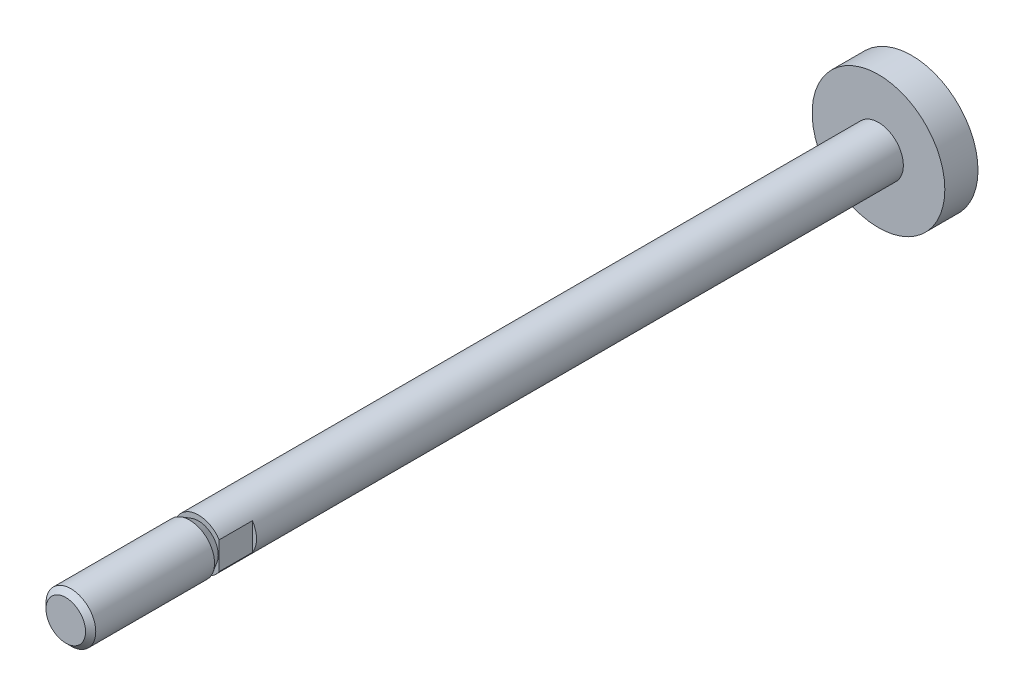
ISO-10303-21;
HEADER;
FILE_DESCRIPTION(('STEP AP214'),'2;1');
FILE_NAME('part.step','',(''),(''),'','','');
FILE_SCHEMA(('AUTOMOTIVE_DESIGN { 1 0 10303 214 1 1 1 1 }'));
ENDSEC;
DATA;
#1=APPLICATION_CONTEXT('core data for automotive mechanical design processes');
#2=APPLICATION_PROTOCOL_DEFINITION('international standard','automotive_design',2000,#1);
#3=PRODUCT_CONTEXT('',#1,'mechanical');
#4=PRODUCT('Part','Part','',(#3));
#5=PRODUCT_RELATED_PRODUCT_CATEGORY('part','',(#4));
#6=PRODUCT_DEFINITION_FORMATION('','',#4);
#7=PRODUCT_DEFINITION_CONTEXT('part definition',#1,'design');
#8=PRODUCT_DEFINITION('design','',#6,#7);
#9=PRODUCT_DEFINITION_SHAPE('','',#8);
#10=(LENGTH_UNIT() NAMED_UNIT(*) SI_UNIT(.MILLI.,.METRE.));
#11=(NAMED_UNIT(*) PLANE_ANGLE_UNIT() SI_UNIT($,.RADIAN.));
#12=(NAMED_UNIT(*) SI_UNIT($,.STERADIAN.) SOLID_ANGLE_UNIT());
#13=UNCERTAINTY_MEASURE_WITH_UNIT(LENGTH_MEASURE(1.E-05),#10,'distance_accuracy_value','');
#14=(GEOMETRIC_REPRESENTATION_CONTEXT(3) GLOBAL_UNCERTAINTY_ASSIGNED_CONTEXT((#13)) GLOBAL_UNIT_ASSIGNED_CONTEXT((#10,
#11,#12)) REPRESENTATION_CONTEXT('',''));
#15=CARTESIAN_POINT('',(0.,0.,0.));
#16=DIRECTION('',(0.,0.,1.));
#17=DIRECTION('',(1.,0.,0.));
#18=AXIS2_PLACEMENT_3D('',#15,#16,#17);
#19=CARTESIAN_POINT('',(0.,2.3865,22.));
#20=DIRECTION('',(0.,0.,-1.));
#21=DIRECTION('',(-1.,0.,0.));
#22=AXIS2_PLACEMENT_3D('',#19,#20,#21);
#23=PLANE('',#22);
#24=CARTESIAN_POINT('',(0.,0.,22.));
#25=DIRECTION('',(0.,0.,1.));
#26=DIRECTION('',(1.,0.,0.));
#27=AXIS2_PLACEMENT_3D('',#24,#25,#26);
#28=CIRCLE('',#27,2.3865);
#29=CARTESIAN_POINT('',(2.3865,0.,22.));
#30=VERTEX_POINT('',#29);
#31=EDGE_CURVE('E96',#30,#30,#28,.T.);
#32=ORIENTED_EDGE('',*,*,#31,.F.);
#33=EDGE_LOOP('',(#32));
#34=FACE_BOUND('',#33,.T.);
#35=DIRECTION('',(0.,-1.,0.));
#36=VECTOR('',#35,1.);
#37=CARTESIAN_POINT('',(-2.5,16.,22.));
#38=LINE('',#37,#36);
#39=CARTESIAN_POINT('',(-2.5,1.6583123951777,22.));
#40=VERTEX_POINT('',#39);
#41=CARTESIAN_POINT('',(-2.5,-1.6583123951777,22.));
#42=VERTEX_POINT('',#41);
#43=EDGE_CURVE('E81',#40,#42,#38,.T.);
#44=ORIENTED_EDGE('',*,*,#43,.T.);
#45=CARTESIAN_POINT('',(0.,0.,22.));
#46=DIRECTION('',(0.,0.,1.));
#47=DIRECTION('',(1.,0.,0.));
#48=AXIS2_PLACEMENT_3D('',#45,#46,#47);
#49=CIRCLE('',#48,3.);
#50=CARTESIAN_POINT('',(2.5,-1.6583123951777,22.));
#51=VERTEX_POINT('',#50);
#52=EDGE_CURVE('E86',#42,#51,#49,.T.);
#53=ORIENTED_EDGE('',*,*,#52,.T.);
#54=DIRECTION('',(0.,-1.,0.));
#55=VECTOR('',#54,1.);
#56=CARTESIAN_POINT('',(2.5,16.,22.));
#57=LINE('',#56,#55);
#58=CARTESIAN_POINT('',(2.5,1.6583123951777,22.));
#59=VERTEX_POINT('',#58);
#60=EDGE_CURVE('E119',#59,#51,#57,.T.);
#61=ORIENTED_EDGE('',*,*,#60,.F.);
#62=EDGE_CURVE('E92',#59,#40,#49,.T.);
#63=ORIENTED_EDGE('',*,*,#62,.T.);
#64=EDGE_LOOP('',(#44,#53,#61,#63));
#65=FACE_BOUND('',#64,.T.);
#66=ADVANCED_FACE('F33',(#34,#65),#23,.F.);
#67=CARTESIAN_POINT('',(0.,0.,-64.));
#68=DIRECTION('',(0.,0.,1.));
#69=DIRECTION('',(1.,0.,0.));
#70=AXIS2_PLACEMENT_3D('',#67,#68,#69);
#71=CYLINDRICAL_SURFACE('',#70,3.);
#72=CARTESIAN_POINT('',(0.,0.,-60.));
#73=DIRECTION('',(0.,0.,1.));
#74=DIRECTION('',(1.,0.,0.));
#75=AXIS2_PLACEMENT_3D('',#72,#73,#74);
#76=CIRCLE('',#75,3.);
#77=CARTESIAN_POINT('',(3.,0.,-60.));
#78=VERTEX_POINT('',#77);
#79=EDGE_CURVE('E93',#78,#78,#76,.T.);
#80=ORIENTED_EDGE('',*,*,#79,.T.);
#81=EDGE_LOOP('',(#80));
#82=FACE_BOUND('',#81,.T.);
#83=DIRECTION('',(0.,0.,1.));
#84=VECTOR('',#83,1.);
#85=CARTESIAN_POINT('',(-2.5,-1.6583123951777,-64.));
#86=LINE('',#85,#84);
#87=CARTESIAN_POINT('',(-2.5,-1.6583123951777,18.));
#88=VERTEX_POINT('',#87);
#89=EDGE_CURVE('E11',#88,#42,#86,.T.);
#90=ORIENTED_EDGE('',*,*,#89,.F.);
#91=CARTESIAN_POINT('',(0.,0.,18.));
#92=DIRECTION('',(0.,0.,1.));
#93=DIRECTION('',(1.,0.,0.));
#94=AXIS2_PLACEMENT_3D('',#91,#92,#93);
#95=CIRCLE('',#94,3.);
#96=CARTESIAN_POINT('',(-2.5,1.6583123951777,18.));
#97=VERTEX_POINT('',#96);
#98=EDGE_CURVE('E71',#97,#88,#95,.T.);
#99=ORIENTED_EDGE('',*,*,#98,.F.);
#100=DIRECTION('',(0.,0.,1.));
#101=VECTOR('',#100,1.);
#102=CARTESIAN_POINT('',(-2.5,1.6583123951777,-64.));
#103=LINE('',#102,#101);
#104=EDGE_CURVE('E41',#40,#97,#103,.F.);
#105=ORIENTED_EDGE('',*,*,#104,.F.);
#106=ORIENTED_EDGE('',*,*,#62,.F.);
#107=DIRECTION('',(0.,0.,1.));
#108=VECTOR('',#107,1.);
#109=CARTESIAN_POINT('',(2.5,1.6583123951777,-64.));
#110=LINE('',#109,#108);
#111=CARTESIAN_POINT('',(2.5,1.6583123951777,18.));
#112=VERTEX_POINT('',#111);
#113=EDGE_CURVE('E76',#112,#59,#110,.T.);
#114=ORIENTED_EDGE('',*,*,#113,.F.);
#115=CARTESIAN_POINT('',(0.,0.,18.));
#116=DIRECTION('',(0.,0.,1.));
#117=DIRECTION('',(1.,0.,0.));
#118=AXIS2_PLACEMENT_3D('',#115,#116,#117);
#119=CIRCLE('',#118,3.);
#120=CARTESIAN_POINT('',(2.5,-1.6583123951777,18.));
#121=VERTEX_POINT('',#120);
#122=EDGE_CURVE('E113',#121,#112,#119,.T.);
#123=ORIENTED_EDGE('',*,*,#122,.F.);
#124=DIRECTION('',(0.,0.,1.));
#125=VECTOR('',#124,1.);
#126=CARTESIAN_POINT('',(2.5,-1.6583123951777,-64.));
#127=LINE('',#126,#125);
#128=EDGE_CURVE('E88',#51,#121,#127,.F.);
#129=ORIENTED_EDGE('',*,*,#128,.F.);
#130=ORIENTED_EDGE('',*,*,#52,.F.);
#131=EDGE_LOOP('',(#90,#99,#105,#106,#114,#123,#129,#130));
#132=FACE_BOUND('',#131,.T.);
#133=ADVANCED_FACE('F84',(#82,#132),#71,.T.);
#134=CARTESIAN_POINT('',(0.,0.,38.));
#135=DIRECTION('',(0.,0.,-1.));
#136=DIRECTION('',(-1.,0.,0.));
#137=AXIS2_PLACEMENT_3D('',#134,#135,#136);
#138=PLANE('',#137);
#139=CARTESIAN_POINT('',(0.,0.,38.));
#140=DIRECTION('',(0.,0.,1.));
#141=DIRECTION('',(1.,0.,0.));
#142=AXIS2_PLACEMENT_3D('',#139,#140,#141);
#143=CIRCLE('',#142,2.3865);
#144=CARTESIAN_POINT('',(2.3865,0.,38.));
#145=VERTEX_POINT('',#144);
#146=EDGE_CURVE('E110',#145,#145,#143,.T.);
#147=ORIENTED_EDGE('',*,*,#146,.T.);
#148=EDGE_LOOP('',(#147));
#149=FACE_BOUND('',#148,.T.);
#150=ADVANCED_FACE('F35',(#149),#138,.F.);
#151=CARTESIAN_POINT('',(0.,0.,37.3865));
#152=DIRECTION('',(0.,0.,-1.));
#153=DIRECTION('',(-1.,0.,0.));
#154=AXIS2_PLACEMENT_3D('',#151,#152,#153);
#155=CONICAL_SURFACE('',#154,3.,0.785398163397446);
#156=ORIENTED_EDGE('',*,*,#146,.F.);
#157=EDGE_LOOP('',(#156));
#158=FACE_BOUND('',#157,.T.);
#159=CARTESIAN_POINT('',(0.,0.,37.3865));
#160=DIRECTION('',(0.,0.,1.));
#161=DIRECTION('',(1.,0.,0.));
#162=AXIS2_PLACEMENT_3D('',#159,#160,#161);
#163=CIRCLE('',#162,3.);
#164=CARTESIAN_POINT('',(3.,0.,37.3865));
#165=VERTEX_POINT('',#164);
#166=EDGE_CURVE('E107',#165,#165,#163,.T.);
#167=ORIENTED_EDGE('',*,*,#166,.T.);
#168=EDGE_LOOP('',(#167));
#169=FACE_BOUND('',#168,.T.);
#170=ADVANCED_FACE('F163',(#158,#169),#155,.T.);
#171=CARTESIAN_POINT('',(0.,0.,-64.));
#172=DIRECTION('',(0.,0.,1.));
#173=DIRECTION('',(1.,0.,0.));
#174=AXIS2_PLACEMENT_3D('',#171,#172,#173);
#175=CYLINDRICAL_SURFACE('',#174,3.);
#176=ORIENTED_EDGE('',*,*,#166,.F.);
#177=EDGE_LOOP('',(#176));
#178=FACE_BOUND('',#177,.T.);
#179=CARTESIAN_POINT('',(0.,0.,23.062613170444));
#180=DIRECTION('',(0.,0.,1.));
#181=DIRECTION('',(1.,0.,0.));
#182=AXIS2_PLACEMENT_3D('',#179,#180,#181);
#183=CIRCLE('',#182,3.);
#184=CARTESIAN_POINT('',(3.,0.,23.062613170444));
#185=VERTEX_POINT('',#184);
#186=EDGE_CURVE('E104',#185,#185,#183,.T.);
#187=ORIENTED_EDGE('',*,*,#186,.T.);
#188=EDGE_LOOP('',(#187));
#189=FACE_BOUND('',#188,.T.);
#190=ADVANCED_FACE('F160',(#178,#189),#175,.T.);
#191=CARTESIAN_POINT('',(0.,0.,22.));
#192=DIRECTION('',(0.,0.,1.));
#193=DIRECTION('',(1.,0.,0.));
#194=AXIS2_PLACEMENT_3D('',#191,#192,#193);
#195=CONICAL_SURFACE('',#194,2.3865,0.523598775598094);
#196=ORIENTED_EDGE('',*,*,#186,.F.);
#197=EDGE_LOOP('',(#196));
#198=FACE_BOUND('',#197,.T.);
#199=ORIENTED_EDGE('',*,*,#31,.T.);
#200=EDGE_LOOP('',(#199));
#201=FACE_BOUND('',#200,.T.);
#202=ADVANCED_FACE('F157',(#198,#201),#195,.T.);
#203=CARTESIAN_POINT('',(0.,3.,-60.));
#204=DIRECTION('',(0.,0.,-1.));
#205=DIRECTION('',(-1.,0.,0.));
#206=AXIS2_PLACEMENT_3D('',#203,#204,#205);
#207=PLANE('',#206);
#208=ORIENTED_EDGE('',*,*,#79,.F.);
#209=EDGE_LOOP('',(#208));
#210=FACE_BOUND('',#209,.T.);
#211=CARTESIAN_POINT('',(0.,0.,-60.));
#212=DIRECTION('',(0.,0.,1.));
#213=DIRECTION('',(1.,0.,0.));
#214=AXIS2_PLACEMENT_3D('',#211,#212,#213);
#215=CIRCLE('',#214,8.);
#216=CARTESIAN_POINT('',(8.,0.,-60.));
#217=VERTEX_POINT('',#216);
#218=EDGE_CURVE('E98',#217,#217,#215,.T.);
#219=ORIENTED_EDGE('',*,*,#218,.T.);
#220=EDGE_LOOP('',(#219));
#221=FACE_BOUND('',#220,.T.);
#222=ADVANCED_FACE('F130',(#210,#221),#207,.F.);
#223=CARTESIAN_POINT('',(0.,0.,-64.));
#224=DIRECTION('',(0.,0.,1.));
#225=DIRECTION('',(1.,0.,0.));
#226=AXIS2_PLACEMENT_3D('',#223,#224,#225);
#227=CYLINDRICAL_SURFACE('',#226,8.);
#228=ORIENTED_EDGE('',*,*,#218,.F.);
#229=EDGE_LOOP('',(#228));
#230=FACE_BOUND('',#229,.T.);
#231=CARTESIAN_POINT('',(0.,0.,-64.));
#232=DIRECTION('',(0.,0.,1.));
#233=DIRECTION('',(1.,0.,0.));
#234=AXIS2_PLACEMENT_3D('',#231,#232,#233);
#235=CIRCLE('',#234,8.);
#236=CARTESIAN_POINT('',(8.,0.,-64.));
#237=VERTEX_POINT('',#236);
#238=EDGE_CURVE('E121',#237,#237,#235,.T.);
#239=ORIENTED_EDGE('',*,*,#238,.T.);
#240=EDGE_LOOP('',(#239));
#241=FACE_BOUND('',#240,.T.);
#242=ADVANCED_FACE('F132',(#230,#241),#227,.T.);
#243=CARTESIAN_POINT('',(0.,8.,-64.));
#244=DIRECTION('',(0.,0.,1.));
#245=DIRECTION('',(1.,0.,0.));
#246=AXIS2_PLACEMENT_3D('',#243,#244,#245);
#247=PLANE('',#246);
#248=ORIENTED_EDGE('',*,*,#238,.F.);
#249=EDGE_LOOP('',(#248));
#250=FACE_BOUND('',#249,.T.);
#251=ADVANCED_FACE('F135',(#250),#247,.F.);
#252=CARTESIAN_POINT('',(2.5,16.,18.));
#253=DIRECTION('',(1.,0.,0.));
#254=DIRECTION('',(0.,0.,-1.));
#255=AXIS2_PLACEMENT_3D('',#252,#253,#254);
#256=PLANE('',#255);
#257=ORIENTED_EDGE('',*,*,#113,.T.);
#258=ORIENTED_EDGE('',*,*,#60,.T.);
#259=ORIENTED_EDGE('',*,*,#128,.T.);
#260=DIRECTION('',(0.,-1.,0.));
#261=VECTOR('',#260,1.);
#262=CARTESIAN_POINT('',(2.5,16.,18.));
#263=LINE('',#262,#261);
#264=EDGE_CURVE('E54',#112,#121,#263,.T.);
#265=ORIENTED_EDGE('',*,*,#264,.F.);
#266=EDGE_LOOP('',(#257,#258,#259,#265));
#267=FACE_BOUND('',#266,.T.);
#268=ADVANCED_FACE('F118',(#267),#256,.T.);
#269=CARTESIAN_POINT('',(10.5,16.,18.));
#270=DIRECTION('',(0.,0.,1.));
#271=DIRECTION('',(1.,0.,0.));
#272=AXIS2_PLACEMENT_3D('',#269,#270,#271);
#273=PLANE('',#272);
#274=ORIENTED_EDGE('',*,*,#122,.T.);
#275=ORIENTED_EDGE('',*,*,#264,.T.);
#276=EDGE_LOOP('',(#274,#275));
#277=FACE_BOUND('',#276,.T.);
#278=ADVANCED_FACE('F144',(#277),#273,.T.);
#279=CARTESIAN_POINT('',(-2.5,16.,22.));
#280=DIRECTION('',(-1.,0.,0.));
#281=DIRECTION('',(0.,0.,1.));
#282=AXIS2_PLACEMENT_3D('',#279,#280,#281);
#283=PLANE('',#282);
#284=ORIENTED_EDGE('',*,*,#89,.T.);
#285=ORIENTED_EDGE('',*,*,#43,.F.);
#286=ORIENTED_EDGE('',*,*,#104,.T.);
#287=DIRECTION('',(0.,-1.,0.));
#288=VECTOR('',#287,1.);
#289=CARTESIAN_POINT('',(-2.5,16.,18.));
#290=LINE('',#289,#288);
#291=EDGE_CURVE('E47',#97,#88,#290,.T.);
#292=ORIENTED_EDGE('',*,*,#291,.T.);
#293=EDGE_LOOP('',(#284,#285,#286,#292));
#294=FACE_BOUND('',#293,.T.);
#295=ADVANCED_FACE('F79',(#294),#283,.T.);
#296=CARTESIAN_POINT('',(-2.5,16.,18.));
#297=DIRECTION('',(0.,0.,1.));
#298=DIRECTION('',(1.,0.,0.));
#299=AXIS2_PLACEMENT_3D('',#296,#297,#298);
#300=PLANE('',#299);
#301=ORIENTED_EDGE('',*,*,#98,.T.);
#302=ORIENTED_EDGE('',*,*,#291,.F.);
#303=EDGE_LOOP('',(#301,#302));
#304=FACE_BOUND('',#303,.T.);
#305=ADVANCED_FACE('F72',(#304),#300,.T.);
#306=CLOSED_SHELL('',(#66,#133,#150,#170,#190,#202,#222,#242,#251,#268,#278,#295,#305));
#307=MANIFOLD_SOLID_BREP('B2',#306);
#308=ADVANCED_BREP_SHAPE_REPRESENTATION('',(#18,#307),#14);
#309=SHAPE_DEFINITION_REPRESENTATION(#9,#308);
ENDSEC;
END-ISO-10303-21;
